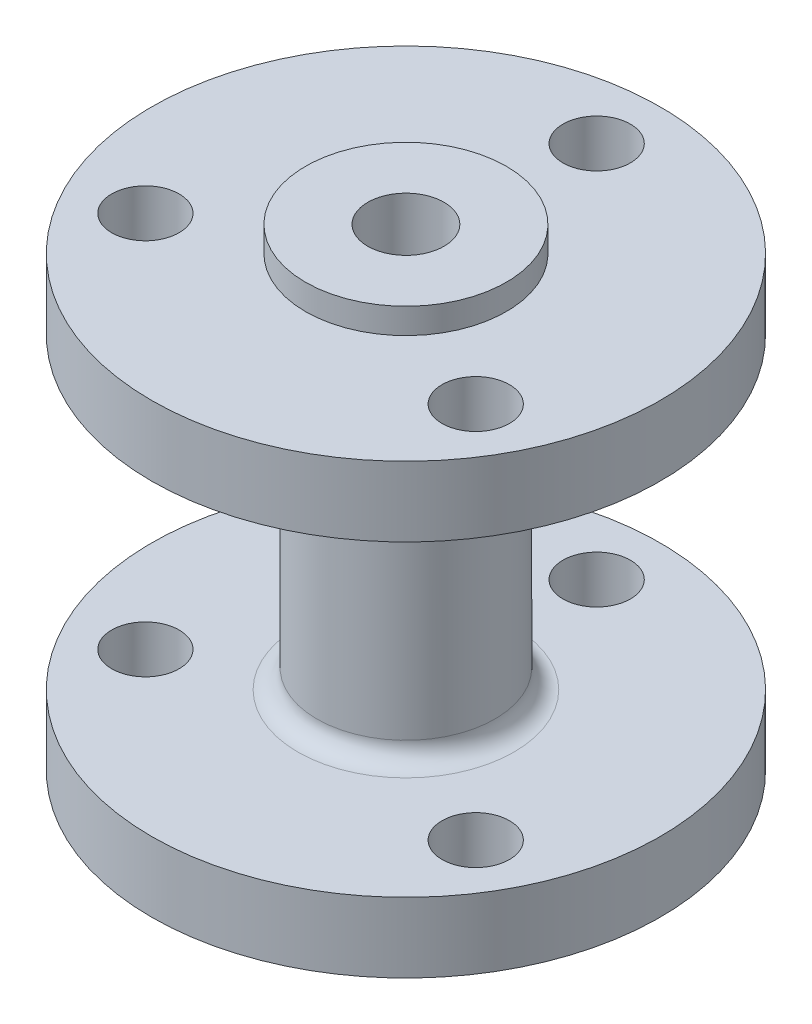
ISO-10303-21;
HEADER;
FILE_DESCRIPTION(('STEP AP214'),'2;1');
FILE_NAME('part.step','',(''),(''),'','','');
FILE_SCHEMA(('AUTOMOTIVE_DESIGN { 1 0 10303 214 1 1 1 1 }'));
ENDSEC;
DATA;
#1=APPLICATION_CONTEXT('core data for automotive mechanical design processes');
#2=APPLICATION_PROTOCOL_DEFINITION('international standard','automotive_design',2000,#1);
#3=PRODUCT_CONTEXT('',#1,'mechanical');
#4=PRODUCT('Part','Part','',(#3));
#5=PRODUCT_RELATED_PRODUCT_CATEGORY('part','',(#4));
#6=PRODUCT_DEFINITION_FORMATION('','',#4);
#7=PRODUCT_DEFINITION_CONTEXT('part definition',#1,'design');
#8=PRODUCT_DEFINITION('design','',#6,#7);
#9=PRODUCT_DEFINITION_SHAPE('','',#8);
#10=(LENGTH_UNIT() NAMED_UNIT(*) SI_UNIT(.MILLI.,.METRE.));
#11=(NAMED_UNIT(*) PLANE_ANGLE_UNIT() SI_UNIT($,.RADIAN.));
#12=(NAMED_UNIT(*) SI_UNIT($,.STERADIAN.) SOLID_ANGLE_UNIT());
#13=UNCERTAINTY_MEASURE_WITH_UNIT(LENGTH_MEASURE(1.E-05),#10,'distance_accuracy_value','');
#14=(GEOMETRIC_REPRESENTATION_CONTEXT(3) GLOBAL_UNCERTAINTY_ASSIGNED_CONTEXT((#13)) GLOBAL_UNIT_ASSIGNED_CONTEXT((#10,
#11,#12)) REPRESENTATION_CONTEXT('',''));
#15=CARTESIAN_POINT('',(0.,0.,0.));
#16=DIRECTION('',(0.,0.,1.));
#17=DIRECTION('',(1.,0.,0.));
#18=AXIS2_PLACEMENT_3D('',#15,#16,#17);
#19=CARTESIAN_POINT('',(0.,19.6,0.));
#20=DIRECTION('',(0.,1.,0.));
#21=DIRECTION('',(0.,0.,1.));
#22=AXIS2_PLACEMENT_3D('',#19,#20,#21);
#23=PLANE('',#22);
#24=CARTESIAN_POINT('',(0.,19.6,0.));
#25=DIRECTION('',(0.,1.,0.));
#26=DIRECTION('',(0.,0.,1.));
#27=AXIS2_PLACEMENT_3D('',#24,#25,#26);
#28=CIRCLE('',#27,2.99999999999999);
#29=CARTESIAN_POINT('',(0.,19.6,2.99999999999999));
#30=VERTEX_POINT('',#29);
#31=EDGE_CURVE('E114',#30,#30,#28,.T.);
#32=ORIENTED_EDGE('',*,*,#31,.F.);
#33=EDGE_LOOP('',(#32));
#34=FACE_BOUND('',#33,.T.);
#35=CARTESIAN_POINT('',(0.,19.6,0.));
#36=DIRECTION('',(0.,1.,0.));
#37=DIRECTION('',(0.,0.,1.));
#38=AXIS2_PLACEMENT_3D('',#35,#36,#37);
#39=CIRCLE('',#38,7.90000000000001);
#40=CARTESIAN_POINT('',(0.,19.6,7.90000000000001));
#41=VERTEX_POINT('',#40);
#42=EDGE_CURVE('E66',#41,#41,#39,.T.);
#43=ORIENTED_EDGE('',*,*,#42,.T.);
#44=EDGE_LOOP('',(#43));
#45=FACE_BOUND('',#44,.T.);
#46=ADVANCED_FACE('F38',(#34,#45),#23,.T.);
#47=CARTESIAN_POINT('',(0.,50.,0.));
#48=DIRECTION('',(0.,1.,0.));
#49=DIRECTION('',(0.,0.,1.));
#50=AXIS2_PLACEMENT_3D('',#47,#48,#49);
#51=CYLINDRICAL_SURFACE('',#50,7.90000000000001);
#52=CARTESIAN_POINT('',(0.,17.6,0.));
#53=DIRECTION('',(0.,1.,0.));
#54=DIRECTION('',(0.,0.,1.));
#55=AXIS2_PLACEMENT_3D('',#52,#53,#54);
#56=CIRCLE('',#55,7.90000000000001);
#57=CARTESIAN_POINT('',(0.,17.6,7.90000000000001));
#58=VERTEX_POINT('',#57);
#59=EDGE_CURVE('E82',#58,#58,#56,.T.);
#60=ORIENTED_EDGE('',*,*,#59,.T.);
#61=EDGE_LOOP('',(#60));
#62=FACE_BOUND('',#61,.T.);
#63=ORIENTED_EDGE('',*,*,#42,.F.);
#64=EDGE_LOOP('',(#63));
#65=FACE_BOUND('',#64,.T.);
#66=ADVANCED_FACE('F163',(#62,#65),#51,.T.);
#67=CARTESIAN_POINT('',(0.,17.6,7.90000000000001));
#68=DIRECTION('',(0.,1.,0.));
#69=DIRECTION('',(0.,0.,1.));
#70=AXIS2_PLACEMENT_3D('',#67,#68,#69);
#71=PLANE('',#70);
#72=CARTESIAN_POINT('',(-12.9903810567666,17.6,7.49999999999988));
#73=DIRECTION('',(0.,1.,0.));
#74=DIRECTION('',(0.,0.,1.));
#75=AXIS2_PLACEMENT_3D('',#72,#73,#74);
#76=CIRCLE('',#75,2.65);
#77=CARTESIAN_POINT('',(-12.9903810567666,17.6,10.1499999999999));
#78=VERTEX_POINT('',#77);
#79=EDGE_CURVE('E72',#78,#78,#76,.T.);
#80=ORIENTED_EDGE('',*,*,#79,.F.);
#81=EDGE_LOOP('',(#80));
#82=FACE_BOUND('',#81,.T.);
#83=CARTESIAN_POINT('',(12.9903810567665,17.6,7.50000000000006));
#84=DIRECTION('',(0.,1.,0.));
#85=DIRECTION('',(0.,0.,1.));
#86=AXIS2_PLACEMENT_3D('',#83,#84,#85);
#87=CIRCLE('',#86,2.65);
#88=CARTESIAN_POINT('',(12.9903810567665,17.6,10.1500000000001));
#89=VERTEX_POINT('',#88);
#90=EDGE_CURVE('E140',#89,#89,#87,.T.);
#91=ORIENTED_EDGE('',*,*,#90,.F.);
#92=EDGE_LOOP('',(#91));
#93=FACE_BOUND('',#92,.T.);
#94=CARTESIAN_POINT('',(0.,17.6,-15.));
#95=DIRECTION('',(0.,1.,0.));
#96=DIRECTION('',(0.,0.,1.));
#97=AXIS2_PLACEMENT_3D('',#94,#95,#96);
#98=CIRCLE('',#97,2.65);
#99=CARTESIAN_POINT('',(0.,17.6,-12.35));
#100=VERTEX_POINT('',#99);
#101=EDGE_CURVE('E78',#100,#100,#98,.T.);
#102=ORIENTED_EDGE('',*,*,#101,.F.);
#103=EDGE_LOOP('',(#102));
#104=FACE_BOUND('',#103,.T.);
#105=CARTESIAN_POINT('',(0.,17.6,0.));
#106=DIRECTION('',(0.,1.,0.));
#107=DIRECTION('',(0.,0.,1.));
#108=AXIS2_PLACEMENT_3D('',#105,#106,#107);
#109=CIRCLE('',#108,20.);
#110=CARTESIAN_POINT('',(0.,17.6,20.));
#111=VERTEX_POINT('',#110);
#112=EDGE_CURVE('E86',#111,#111,#109,.T.);
#113=ORIENTED_EDGE('',*,*,#112,.T.);
#114=EDGE_LOOP('',(#113));
#115=FACE_BOUND('',#114,.T.);
#116=ORIENTED_EDGE('',*,*,#59,.F.);
#117=EDGE_LOOP('',(#116));
#118=FACE_BOUND('',#117,.T.);
#119=ADVANCED_FACE('F159',(#82,#93,#104,#115,#118),#71,.T.);
#120=CARTESIAN_POINT('',(0.,50.,0.));
#121=DIRECTION('',(0.,1.,0.));
#122=DIRECTION('',(0.,0.,1.));
#123=AXIS2_PLACEMENT_3D('',#120,#121,#122);
#124=CYLINDRICAL_SURFACE('',#123,20.);
#125=CARTESIAN_POINT('',(0.,12.1,0.));
#126=DIRECTION('',(0.,1.,0.));
#127=DIRECTION('',(0.,0.,1.));
#128=AXIS2_PLACEMENT_3D('',#125,#126,#127);
#129=CIRCLE('',#128,20.);
#130=CARTESIAN_POINT('',(0.,12.1,20.));
#131=VERTEX_POINT('',#130);
#132=EDGE_CURVE('E90',#131,#131,#129,.T.);
#133=ORIENTED_EDGE('',*,*,#132,.T.);
#134=EDGE_LOOP('',(#133));
#135=FACE_BOUND('',#134,.T.);
#136=ORIENTED_EDGE('',*,*,#112,.F.);
#137=EDGE_LOOP('',(#136));
#138=FACE_BOUND('',#137,.T.);
#139=ADVANCED_FACE('F162',(#135,#138),#124,.T.);
#140=CARTESIAN_POINT('',(0.,12.1,20.));
#141=DIRECTION('',(0.,-1.,0.));
#142=DIRECTION('',(0.,0.,-1.));
#143=AXIS2_PLACEMENT_3D('',#140,#141,#142);
#144=PLANE('',#143);
#145=CARTESIAN_POINT('',(0.,12.1,0.));
#146=DIRECTION('',(0.,-1.,0.));
#147=DIRECTION('',(0.,0.,-1.));
#148=AXIS2_PLACEMENT_3D('',#145,#146,#147);
#149=CIRCLE('',#148,8.5);
#150=CARTESIAN_POINT('',(0.,12.1,-8.5));
#151=VERTEX_POINT('',#150);
#152=EDGE_CURVE('E10',#151,#151,#149,.F.);
#153=ORIENTED_EDGE('',*,*,#152,.T.);
#154=EDGE_LOOP('',(#153));
#155=FACE_BOUND('',#154,.T.);
#156=CARTESIAN_POINT('',(-12.9903810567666,12.1,7.49999999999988));
#157=DIRECTION('',(0.,-1.,0.));
#158=DIRECTION('',(0.,0.,-1.));
#159=AXIS2_PLACEMENT_3D('',#156,#157,#158);
#160=CIRCLE('',#159,2.65);
#161=CARTESIAN_POINT('',(-12.9903810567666,12.1,4.84999999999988));
#162=VERTEX_POINT('',#161);
#163=EDGE_CURVE('E67',#162,#162,#160,.T.);
#164=ORIENTED_EDGE('',*,*,#163,.F.);
#165=EDGE_LOOP('',(#164));
#166=FACE_BOUND('',#165,.T.);
#167=CARTESIAN_POINT('',(12.9903810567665,12.1,7.50000000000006));
#168=DIRECTION('',(0.,-1.,0.));
#169=DIRECTION('',(0.,0.,-1.));
#170=AXIS2_PLACEMENT_3D('',#167,#168,#169);
#171=CIRCLE('',#170,2.64999999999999);
#172=CARTESIAN_POINT('',(12.9903810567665,12.1,4.85000000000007));
#173=VERTEX_POINT('',#172);
#174=EDGE_CURVE('E128',#173,#173,#171,.T.);
#175=ORIENTED_EDGE('',*,*,#174,.F.);
#176=EDGE_LOOP('',(#175));
#177=FACE_BOUND('',#176,.T.);
#178=CARTESIAN_POINT('',(0.,12.1,-15.));
#179=DIRECTION('',(0.,-1.,0.));
#180=DIRECTION('',(0.,0.,-1.));
#181=AXIS2_PLACEMENT_3D('',#178,#179,#180);
#182=CIRCLE('',#181,2.65);
#183=CARTESIAN_POINT('',(0.,12.1,-17.65));
#184=VERTEX_POINT('',#183);
#185=EDGE_CURVE('E73',#184,#184,#182,.T.);
#186=ORIENTED_EDGE('',*,*,#185,.F.);
#187=EDGE_LOOP('',(#186));
#188=FACE_BOUND('',#187,.T.);
#189=ORIENTED_EDGE('',*,*,#132,.F.);
#190=EDGE_LOOP('',(#189));
#191=FACE_BOUND('',#190,.T.);
#192=ADVANCED_FACE('F202',(#155,#166,#177,#188,#191),#144,.T.);
#193=CARTESIAN_POINT('',(0.,50.,0.));
#194=DIRECTION('',(0.,1.,0.));
#195=DIRECTION('',(0.,0.,1.));
#196=AXIS2_PLACEMENT_3D('',#193,#194,#195);
#197=CYLINDRICAL_SURFACE('',#196,7.);
#198=CARTESIAN_POINT('',(0.,-10.6,0.));
#199=DIRECTION('',(0.,1.,0.));
#200=DIRECTION('',(0.,0.,1.));
#201=AXIS2_PLACEMENT_3D('',#198,#199,#200);
#202=CIRCLE('',#201,7.);
#203=CARTESIAN_POINT('',(0.,-10.6,7.));
#204=VERTEX_POINT('',#203);
#205=EDGE_CURVE('E53',#204,#204,#202,.T.);
#206=ORIENTED_EDGE('',*,*,#205,.T.);
#207=EDGE_LOOP('',(#206));
#208=FACE_BOUND('',#207,.T.);
#209=CARTESIAN_POINT('',(0.,10.6,0.));
#210=DIRECTION('',(0.,-1.,0.));
#211=DIRECTION('',(0.,0.,-1.));
#212=AXIS2_PLACEMENT_3D('',#209,#210,#211);
#213=CIRCLE('',#212,7.);
#214=CARTESIAN_POINT('',(0.,10.6,-7.));
#215=VERTEX_POINT('',#214);
#216=EDGE_CURVE('E60',#215,#215,#213,.T.);
#217=ORIENTED_EDGE('',*,*,#216,.T.);
#218=EDGE_LOOP('',(#217));
#219=FACE_BOUND('',#218,.T.);
#220=ADVANCED_FACE('F198',(#208,#219),#197,.T.);
#221=CARTESIAN_POINT('',(0.,-12.1,7.));
#222=DIRECTION('',(0.,1.,0.));
#223=DIRECTION('',(0.,0.,1.));
#224=AXIS2_PLACEMENT_3D('',#221,#222,#223);
#225=PLANE('',#224);
#226=CARTESIAN_POINT('',(0.,-12.1,0.));
#227=DIRECTION('',(0.,1.,0.));
#228=DIRECTION('',(0.,0.,1.));
#229=AXIS2_PLACEMENT_3D('',#226,#227,#228);
#230=CIRCLE('',#229,8.5);
#231=CARTESIAN_POINT('',(0.,-12.1,8.5));
#232=VERTEX_POINT('',#231);
#233=EDGE_CURVE('E46',#232,#232,#230,.F.);
#234=ORIENTED_EDGE('',*,*,#233,.T.);
#235=EDGE_LOOP('',(#234));
#236=FACE_BOUND('',#235,.T.);
#237=CARTESIAN_POINT('',(-12.9903810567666,-12.1,7.49999999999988));
#238=DIRECTION('',(0.,1.,0.));
#239=DIRECTION('',(0.,0.,1.));
#240=AXIS2_PLACEMENT_3D('',#237,#238,#239);
#241=CIRCLE('',#240,2.65);
#242=CARTESIAN_POINT('',(-12.9903810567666,-12.1,10.1499999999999));
#243=VERTEX_POINT('',#242);
#244=EDGE_CURVE('E144',#243,#243,#241,.T.);
#245=ORIENTED_EDGE('',*,*,#244,.F.);
#246=EDGE_LOOP('',(#245));
#247=FACE_BOUND('',#246,.T.);
#248=CARTESIAN_POINT('',(12.9903810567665,-12.1,7.50000000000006));
#249=DIRECTION('',(0.,1.,0.));
#250=DIRECTION('',(0.,0.,1.));
#251=AXIS2_PLACEMENT_3D('',#248,#249,#250);
#252=CIRCLE('',#251,2.64999999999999);
#253=CARTESIAN_POINT('',(12.9903810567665,-12.1,10.1500000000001));
#254=VERTEX_POINT('',#253);
#255=EDGE_CURVE('E136',#254,#254,#252,.T.);
#256=ORIENTED_EDGE('',*,*,#255,.F.);
#257=EDGE_LOOP('',(#256));
#258=FACE_BOUND('',#257,.T.);
#259=CARTESIAN_POINT('',(0.,-12.1,-15.));
#260=DIRECTION('',(0.,1.,0.));
#261=DIRECTION('',(0.,0.,1.));
#262=AXIS2_PLACEMENT_3D('',#259,#260,#261);
#263=CIRCLE('',#262,2.65);
#264=CARTESIAN_POINT('',(0.,-12.1,-12.35));
#265=VERTEX_POINT('',#264);
#266=EDGE_CURVE('E118',#265,#265,#263,.T.);
#267=ORIENTED_EDGE('',*,*,#266,.F.);
#268=EDGE_LOOP('',(#267));
#269=FACE_BOUND('',#268,.T.);
#270=CARTESIAN_POINT('',(0.,-12.1,0.));
#271=DIRECTION('',(0.,1.,0.));
#272=DIRECTION('',(0.,0.,1.));
#273=AXIS2_PLACEMENT_3D('',#270,#271,#272);
#274=CIRCLE('',#273,20.);
#275=CARTESIAN_POINT('',(0.,-12.1,20.));
#276=VERTEX_POINT('',#275);
#277=EDGE_CURVE('E94',#276,#276,#274,.T.);
#278=ORIENTED_EDGE('',*,*,#277,.T.);
#279=EDGE_LOOP('',(#278));
#280=FACE_BOUND('',#279,.T.);
#281=ADVANCED_FACE('F201',(#236,#247,#258,#269,#280),#225,.T.);
#282=CARTESIAN_POINT('',(0.,50.,0.));
#283=DIRECTION('',(0.,1.,0.));
#284=DIRECTION('',(0.,0.,1.));
#285=AXIS2_PLACEMENT_3D('',#282,#283,#284);
#286=CYLINDRICAL_SURFACE('',#285,20.);
#287=CARTESIAN_POINT('',(0.,-17.6,0.));
#288=DIRECTION('',(0.,1.,0.));
#289=DIRECTION('',(0.,0.,1.));
#290=AXIS2_PLACEMENT_3D('',#287,#288,#289);
#291=CIRCLE('',#290,20.);
#292=CARTESIAN_POINT('',(0.,-17.6,20.));
#293=VERTEX_POINT('',#292);
#294=EDGE_CURVE('E98',#293,#293,#291,.T.);
#295=ORIENTED_EDGE('',*,*,#294,.T.);
#296=EDGE_LOOP('',(#295));
#297=FACE_BOUND('',#296,.T.);
#298=ORIENTED_EDGE('',*,*,#277,.F.);
#299=EDGE_LOOP('',(#298));
#300=FACE_BOUND('',#299,.T.);
#301=ADVANCED_FACE('F210',(#297,#300),#286,.T.);
#302=CARTESIAN_POINT('',(0.,-17.6,20.));
#303=DIRECTION('',(0.,-1.,0.));
#304=DIRECTION('',(0.,0.,-1.));
#305=AXIS2_PLACEMENT_3D('',#302,#303,#304);
#306=PLANE('',#305);
#307=CARTESIAN_POINT('',(-12.9903810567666,-17.6,7.49999999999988));
#308=DIRECTION('',(0.,-1.,0.));
#309=DIRECTION('',(0.,0.,-1.));
#310=AXIS2_PLACEMENT_3D('',#307,#308,#309);
#311=CIRCLE('',#310,2.65);
#312=CARTESIAN_POINT('',(-12.9903810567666,-17.6,4.84999999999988));
#313=VERTEX_POINT('',#312);
#314=EDGE_CURVE('E71',#313,#313,#311,.T.);
#315=ORIENTED_EDGE('',*,*,#314,.F.);
#316=EDGE_LOOP('',(#315));
#317=FACE_BOUND('',#316,.T.);
#318=CARTESIAN_POINT('',(12.9903810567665,-17.6,7.50000000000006));
#319=DIRECTION('',(0.,-1.,0.));
#320=DIRECTION('',(0.,0.,-1.));
#321=AXIS2_PLACEMENT_3D('',#318,#319,#320);
#322=CIRCLE('',#321,2.64999999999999);
#323=CARTESIAN_POINT('',(12.9903810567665,-17.6,4.85000000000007));
#324=VERTEX_POINT('',#323);
#325=EDGE_CURVE('E132',#324,#324,#322,.T.);
#326=ORIENTED_EDGE('',*,*,#325,.F.);
#327=EDGE_LOOP('',(#326));
#328=FACE_BOUND('',#327,.T.);
#329=CARTESIAN_POINT('',(0.,-17.6,-15.));
#330=DIRECTION('',(0.,-1.,0.));
#331=DIRECTION('',(0.,0.,-1.));
#332=AXIS2_PLACEMENT_3D('',#329,#330,#331);
#333=CIRCLE('',#332,2.65);
#334=CARTESIAN_POINT('',(0.,-17.6,-17.65));
#335=VERTEX_POINT('',#334);
#336=EDGE_CURVE('E77',#335,#335,#333,.T.);
#337=ORIENTED_EDGE('',*,*,#336,.F.);
#338=EDGE_LOOP('',(#337));
#339=FACE_BOUND('',#338,.T.);
#340=CARTESIAN_POINT('',(0.,-17.6,0.));
#341=DIRECTION('',(0.,1.,0.));
#342=DIRECTION('',(0.,0.,1.));
#343=AXIS2_PLACEMENT_3D('',#340,#341,#342);
#344=CIRCLE('',#343,7.9);
#345=CARTESIAN_POINT('',(0.,-17.6,7.9));
#346=VERTEX_POINT('',#345);
#347=EDGE_CURVE('E102',#346,#346,#344,.T.);
#348=ORIENTED_EDGE('',*,*,#347,.T.);
#349=EDGE_LOOP('',(#348));
#350=FACE_BOUND('',#349,.T.);
#351=ORIENTED_EDGE('',*,*,#294,.F.);
#352=EDGE_LOOP('',(#351));
#353=FACE_BOUND('',#352,.T.);
#354=ADVANCED_FACE('F244',(#317,#328,#339,#350,#353),#306,.T.);
#355=CARTESIAN_POINT('',(0.,50.,0.));
#356=DIRECTION('',(0.,1.,0.));
#357=DIRECTION('',(0.,0.,1.));
#358=AXIS2_PLACEMENT_3D('',#355,#356,#357);
#359=CYLINDRICAL_SURFACE('',#358,7.9);
#360=CARTESIAN_POINT('',(0.,-19.6,0.));
#361=DIRECTION('',(0.,1.,0.));
#362=DIRECTION('',(0.,0.,1.));
#363=AXIS2_PLACEMENT_3D('',#360,#361,#362);
#364=CIRCLE('',#363,7.9);
#365=CARTESIAN_POINT('',(0.,-19.6,7.9));
#366=VERTEX_POINT('',#365);
#367=EDGE_CURVE('E106',#366,#366,#364,.T.);
#368=ORIENTED_EDGE('',*,*,#367,.T.);
#369=EDGE_LOOP('',(#368));
#370=FACE_BOUND('',#369,.T.);
#371=ORIENTED_EDGE('',*,*,#347,.F.);
#372=EDGE_LOOP('',(#371));
#373=FACE_BOUND('',#372,.T.);
#374=ADVANCED_FACE('F252',(#370,#373),#359,.T.);
#375=CARTESIAN_POINT('',(0.,-19.6,7.9));
#376=DIRECTION('',(0.,-1.,0.));
#377=DIRECTION('',(0.,0.,-1.));
#378=AXIS2_PLACEMENT_3D('',#375,#376,#377);
#379=PLANE('',#378);
#380=CARTESIAN_POINT('',(0.,-19.6,0.));
#381=DIRECTION('',(0.,-1.,0.));
#382=DIRECTION('',(0.,0.,-1.));
#383=AXIS2_PLACEMENT_3D('',#380,#381,#382);
#384=CIRCLE('',#383,2.99999999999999);
#385=CARTESIAN_POINT('',(0.,-19.6,-2.99999999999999));
#386=VERTEX_POINT('',#385);
#387=EDGE_CURVE('E110',#386,#386,#384,.T.);
#388=ORIENTED_EDGE('',*,*,#387,.F.);
#389=EDGE_LOOP('',(#388));
#390=FACE_BOUND('',#389,.T.);
#391=ORIENTED_EDGE('',*,*,#367,.F.);
#392=EDGE_LOOP('',(#391));
#393=FACE_BOUND('',#392,.T.);
#394=ADVANCED_FACE('F261',(#390,#393),#379,.T.);
#395=CARTESIAN_POINT('',(0.,19.6,0.));
#396=DIRECTION('',(0.,1.,0.));
#397=DIRECTION('',(0.,0.,1.));
#398=AXIS2_PLACEMENT_3D('',#395,#396,#397);
#399=CYLINDRICAL_SURFACE('',#398,2.99999999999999);
#400=ORIENTED_EDGE('',*,*,#31,.T.);
#401=EDGE_LOOP('',(#400));
#402=FACE_BOUND('',#401,.T.);
#403=ORIENTED_EDGE('',*,*,#387,.T.);
#404=EDGE_LOOP('',(#403));
#405=FACE_BOUND('',#404,.T.);
#406=ADVANCED_FACE('F270',(#402,#405),#399,.F.);
#407=CARTESIAN_POINT('',(0.,17.6,-15.));
#408=DIRECTION('',(0.,1.,0.));
#409=DIRECTION('',(0.,0.,1.));
#410=AXIS2_PLACEMENT_3D('',#407,#408,#409);
#411=CYLINDRICAL_SURFACE('',#410,2.65);
#412=ORIENTED_EDGE('',*,*,#185,.T.);
#413=EDGE_LOOP('',(#412));
#414=FACE_BOUND('',#413,.T.);
#415=ORIENTED_EDGE('',*,*,#101,.T.);
#416=EDGE_LOOP('',(#415));
#417=FACE_BOUND('',#416,.T.);
#418=ADVANCED_FACE('F279',(#414,#417),#411,.F.);
#419=ORIENTED_EDGE('',*,*,#266,.T.);
#420=EDGE_LOOP('',(#419));
#421=FACE_BOUND('',#420,.T.);
#422=ORIENTED_EDGE('',*,*,#336,.T.);
#423=EDGE_LOOP('',(#422));
#424=FACE_BOUND('',#423,.T.);
#425=ADVANCED_FACE('F288',(#421,#424),#411,.F.);
#426=CARTESIAN_POINT('',(12.9903810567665,17.6,7.50000000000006));
#427=DIRECTION('',(0.,1.,0.));
#428=DIRECTION('',(0.,0.,1.));
#429=AXIS2_PLACEMENT_3D('',#426,#427,#428);
#430=CYLINDRICAL_SURFACE('',#429,2.64999999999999);
#431=ORIENTED_EDGE('',*,*,#174,.T.);
#432=EDGE_LOOP('',(#431));
#433=FACE_BOUND('',#432,.T.);
#434=ORIENTED_EDGE('',*,*,#90,.T.);
#435=EDGE_LOOP('',(#434));
#436=FACE_BOUND('',#435,.T.);
#437=ADVANCED_FACE('F297',(#433,#436),#430,.F.);
#438=ORIENTED_EDGE('',*,*,#325,.T.);
#439=EDGE_LOOP('',(#438));
#440=FACE_BOUND('',#439,.T.);
#441=ORIENTED_EDGE('',*,*,#255,.T.);
#442=EDGE_LOOP('',(#441));
#443=FACE_BOUND('',#442,.T.);
#444=ADVANCED_FACE('F305',(#440,#443),#430,.F.);
#445=CARTESIAN_POINT('',(-12.9903810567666,17.6,7.49999999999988));
#446=DIRECTION('',(0.,1.,0.));
#447=DIRECTION('',(0.,0.,1.));
#448=AXIS2_PLACEMENT_3D('',#445,#446,#447);
#449=CYLINDRICAL_SURFACE('',#448,2.65);
#450=ORIENTED_EDGE('',*,*,#163,.T.);
#451=EDGE_LOOP('',(#450));
#452=FACE_BOUND('',#451,.T.);
#453=ORIENTED_EDGE('',*,*,#79,.T.);
#454=EDGE_LOOP('',(#453));
#455=FACE_BOUND('',#454,.T.);
#456=ADVANCED_FACE('F157',(#452,#455),#449,.F.);
#457=ORIENTED_EDGE('',*,*,#244,.T.);
#458=EDGE_LOOP('',(#457));
#459=FACE_BOUND('',#458,.T.);
#460=ORIENTED_EDGE('',*,*,#314,.T.);
#461=EDGE_LOOP('',(#460));
#462=FACE_BOUND('',#461,.T.);
#463=ADVANCED_FACE('F186',(#459,#462),#449,.F.);
#464=CARTESIAN_POINT('',(0.,-10.6,0.));
#465=DIRECTION('',(0.,1.,0.));
#466=DIRECTION('',(0.,0.,1.));
#467=AXIS2_PLACEMENT_3D('',#464,#465,#466);
#468=TOROIDAL_SURFACE('',#467,8.5,1.5);
#469=ORIENTED_EDGE('',*,*,#233,.F.);
#470=EDGE_LOOP('',(#469));
#471=FACE_BOUND('',#470,.T.);
#472=ORIENTED_EDGE('',*,*,#205,.F.);
#473=EDGE_LOOP('',(#472));
#474=FACE_BOUND('',#473,.T.);
#475=ADVANCED_FACE('F184',(#471,#474),#468,.F.);
#476=CARTESIAN_POINT('',(0.,10.6,0.));
#477=DIRECTION('',(0.,-1.,0.));
#478=DIRECTION('',(0.,0.,-1.));
#479=AXIS2_PLACEMENT_3D('',#476,#477,#478);
#480=TOROIDAL_SURFACE('',#479,8.5,1.5);
#481=ORIENTED_EDGE('',*,*,#216,.F.);
#482=EDGE_LOOP('',(#481));
#483=FACE_BOUND('',#482,.T.);
#484=ORIENTED_EDGE('',*,*,#152,.F.);
#485=EDGE_LOOP('',(#484));
#486=FACE_BOUND('',#485,.T.);
#487=ADVANCED_FACE('F40',(#483,#486),#480,.F.);
#488=CLOSED_SHELL('',(#46,#66,#119,#139,#192,#220,#281,#301,#354,#374,#394,#406,#418,#425,#437,
#444,#456,#463,#475,#487));
#489=MANIFOLD_SOLID_BREP('B2',#488);
#490=ADVANCED_BREP_SHAPE_REPRESENTATION('',(#18,#489),#14);
#491=SHAPE_DEFINITION_REPRESENTATION(#9,#490);
ENDSEC;
END-ISO-10303-21;
